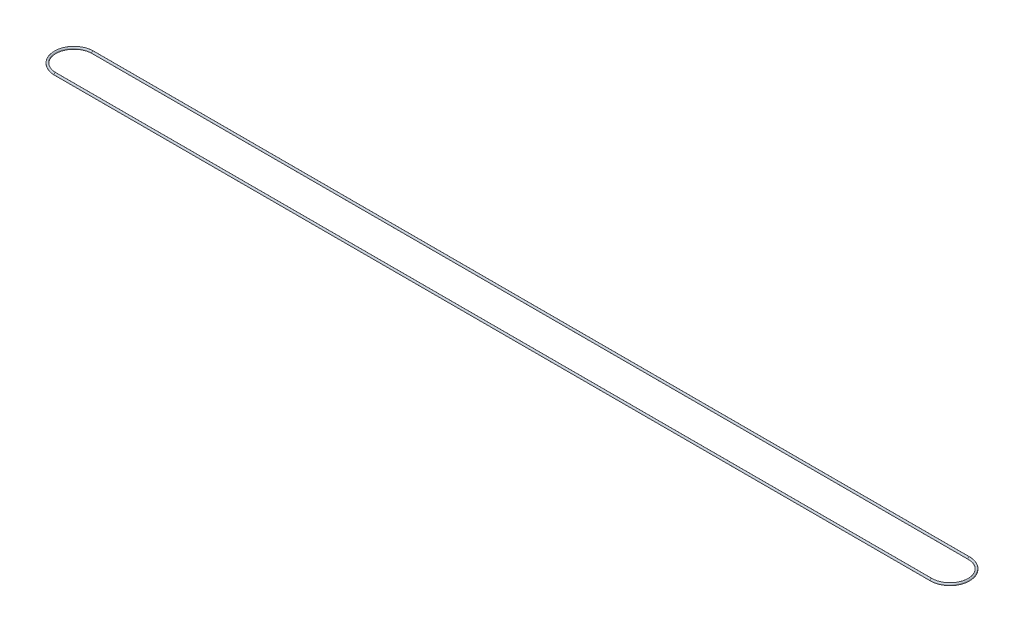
ISO-10303-21;
HEADER;
FILE_DESCRIPTION(('STEP AP214'),'2;1');
FILE_NAME('part.step','',(''),(''),'','','');
FILE_SCHEMA(('AUTOMOTIVE_DESIGN { 1 0 10303 214 1 1 1 1 }'));
ENDSEC;
DATA;
#1=APPLICATION_CONTEXT('core data for automotive mechanical design processes');
#2=APPLICATION_PROTOCOL_DEFINITION('international standard','automotive_design',2000,#1);
#3=PRODUCT_CONTEXT('',#1,'mechanical');
#4=PRODUCT('Part','Part','',(#3));
#5=PRODUCT_RELATED_PRODUCT_CATEGORY('part','',(#4));
#6=PRODUCT_DEFINITION_FORMATION('','',#4);
#7=PRODUCT_DEFINITION_CONTEXT('part definition',#1,'design');
#8=PRODUCT_DEFINITION('design','',#6,#7);
#9=PRODUCT_DEFINITION_SHAPE('','',#8);
#10=(LENGTH_UNIT() NAMED_UNIT(*) SI_UNIT(.MILLI.,.METRE.));
#11=(NAMED_UNIT(*) PLANE_ANGLE_UNIT() SI_UNIT($,.RADIAN.));
#12=(NAMED_UNIT(*) SI_UNIT($,.STERADIAN.) SOLID_ANGLE_UNIT());
#13=UNCERTAINTY_MEASURE_WITH_UNIT(LENGTH_MEASURE(1.E-05),#10,'distance_accuracy_value','');
#14=(GEOMETRIC_REPRESENTATION_CONTEXT(3) GLOBAL_UNCERTAINTY_ASSIGNED_CONTEXT((#13)) GLOBAL_UNIT_ASSIGNED_CONTEXT((#10,
#11,#12)) REPRESENTATION_CONTEXT('',''));
#15=CARTESIAN_POINT('',(0.,0.,0.));
#16=DIRECTION('',(0.,0.,1.));
#17=DIRECTION('',(1.,0.,0.));
#18=AXIS2_PLACEMENT_3D('',#15,#16,#17);
#19=CARTESIAN_POINT('',(1333.5,0.,0.));
#20=DIRECTION('',(0.,1.,0.));
#21=DIRECTION('',(0.,0.,1.));
#22=AXIS2_PLACEMENT_3D('',#19,#20,#21);
#23=TOROIDAL_SURFACE('',#22,57.15,3.175);
#24=CARTESIAN_POINT('',(1333.5,0.,57.15));
#25=DIRECTION('',(-1.,0.,0.));
#26=DIRECTION('',(0.,0.,1.));
#27=AXIS2_PLACEMENT_3D('',#24,#25,#26);
#28=CIRCLE('',#27,3.175);
#29=CARTESIAN_POINT('',(1333.5,0.,60.325));
#30=VERTEX_POINT('',#29);
#31=EDGE_CURVE('E35',#30,#30,#28,.T.);
#32=CARTESIAN_POINT('',(1333.5,0.,-57.15));
#33=DIRECTION('',(1.,0.,0.));
#34=DIRECTION('',(0.,0.,-1.));
#35=AXIS2_PLACEMENT_3D('',#32,#33,#34);
#36=CIRCLE('',#35,3.175);
#37=CARTESIAN_POINT('',(1333.5,0.,-60.325));
#38=VERTEX_POINT('',#37);
#39=EDGE_CURVE('E10',#38,#38,#36,.T.);
#40=CARTESIAN_POINT('',(1333.5,0.,0.));
#41=DIRECTION('',(0.,1.,0.));
#42=DIRECTION('',(0.,0.,1.));
#43=AXIS2_PLACEMENT_3D('',#40,#41,#42);
#44=CIRCLE('',#43,60.325);
#45=EDGE_CURVE('',#30,#38,#44,.T.);
#46=ORIENTED_EDGE('',*,*,#31,.F.);
#47=ORIENTED_EDGE('',*,*,#39,.T.);
#48=ORIENTED_EDGE('',*,*,#45,.T.);
#49=ORIENTED_EDGE('',*,*,#45,.F.);
#50=EDGE_LOOP('',(#46,#48,#47,#49));
#51=FACE_BOUND('',#50,.T.);
#52=ADVANCED_FACE('F29',(#51),#23,.T.);
#53=CARTESIAN_POINT('',(-1333.5,0.,57.15));
#54=DIRECTION('',(1.,0.,0.));
#55=DIRECTION('',(0.,0.,-1.));
#56=AXIS2_PLACEMENT_3D('',#53,#54,#55);
#57=CYLINDRICAL_SURFACE('',#56,3.175);
#58=CARTESIAN_POINT('',(-1333.5,0.,57.15));
#59=DIRECTION('',(-1.,0.,0.));
#60=DIRECTION('',(0.,0.,1.));
#61=AXIS2_PLACEMENT_3D('',#58,#59,#60);
#62=CIRCLE('',#61,3.175);
#63=CARTESIAN_POINT('',(-1333.5,0.,60.325));
#64=VERTEX_POINT('',#63);
#65=EDGE_CURVE('E39',#64,#64,#62,.T.);
#66=ORIENTED_EDGE('',*,*,#65,.F.);
#67=EDGE_LOOP('',(#66));
#68=FACE_BOUND('',#67,.T.);
#69=ORIENTED_EDGE('',*,*,#31,.T.);
#70=EDGE_LOOP('',(#69));
#71=FACE_BOUND('',#70,.T.);
#72=ADVANCED_FACE('F55',(#68,#71),#57,.T.);
#73=CARTESIAN_POINT('',(-1333.5,0.,0.));
#74=DIRECTION('',(0.,1.,0.));
#75=DIRECTION('',(0.,0.,1.));
#76=AXIS2_PLACEMENT_3D('',#73,#74,#75);
#77=TOROIDAL_SURFACE('',#76,57.15,3.175);
#78=CARTESIAN_POINT('',(-1333.5,0.,-57.15));
#79=DIRECTION('',(1.,0.,0.));
#80=DIRECTION('',(0.,0.,-1.));
#81=AXIS2_PLACEMENT_3D('',#78,#79,#80);
#82=CIRCLE('',#81,3.175);
#83=CARTESIAN_POINT('',(-1333.5,0.,-60.325));
#84=VERTEX_POINT('',#83);
#85=EDGE_CURVE('E43',#84,#84,#82,.T.);
#86=CARTESIAN_POINT('',(-1333.5,0.,0.));
#87=DIRECTION('',(0.,1.,0.));
#88=DIRECTION('',(0.,0.,1.));
#89=AXIS2_PLACEMENT_3D('',#86,#87,#88);
#90=CIRCLE('',#89,60.325);
#91=EDGE_CURVE('',#84,#64,#90,.T.);
#92=ORIENTED_EDGE('',*,*,#85,.F.);
#93=ORIENTED_EDGE('',*,*,#65,.T.);
#94=ORIENTED_EDGE('',*,*,#91,.T.);
#95=ORIENTED_EDGE('',*,*,#91,.F.);
#96=EDGE_LOOP('',(#92,#94,#93,#95));
#97=FACE_BOUND('',#96,.T.);
#98=ADVANCED_FACE('F52',(#97),#77,.T.);
#99=CARTESIAN_POINT('',(-1333.5,0.,-57.15));
#100=DIRECTION('',(1.,0.,0.));
#101=DIRECTION('',(0.,0.,-1.));
#102=AXIS2_PLACEMENT_3D('',#99,#100,#101);
#103=CYLINDRICAL_SURFACE('',#102,3.175);
#104=ORIENTED_EDGE('',*,*,#85,.T.);
#105=EDGE_LOOP('',(#104));
#106=FACE_BOUND('',#105,.T.);
#107=ORIENTED_EDGE('',*,*,#39,.F.);
#108=EDGE_LOOP('',(#107));
#109=FACE_BOUND('',#108,.T.);
#110=ADVANCED_FACE('F49',(#106,#109),#103,.T.);
#111=CLOSED_SHELL('',(#52,#72,#98,#110));
#112=MANIFOLD_SOLID_BREP('B2',#111);
#113=ADVANCED_BREP_SHAPE_REPRESENTATION('',(#18,#112),#14);
#114=SHAPE_DEFINITION_REPRESENTATION(#9,#113);
ENDSEC;
END-ISO-10303-21;
